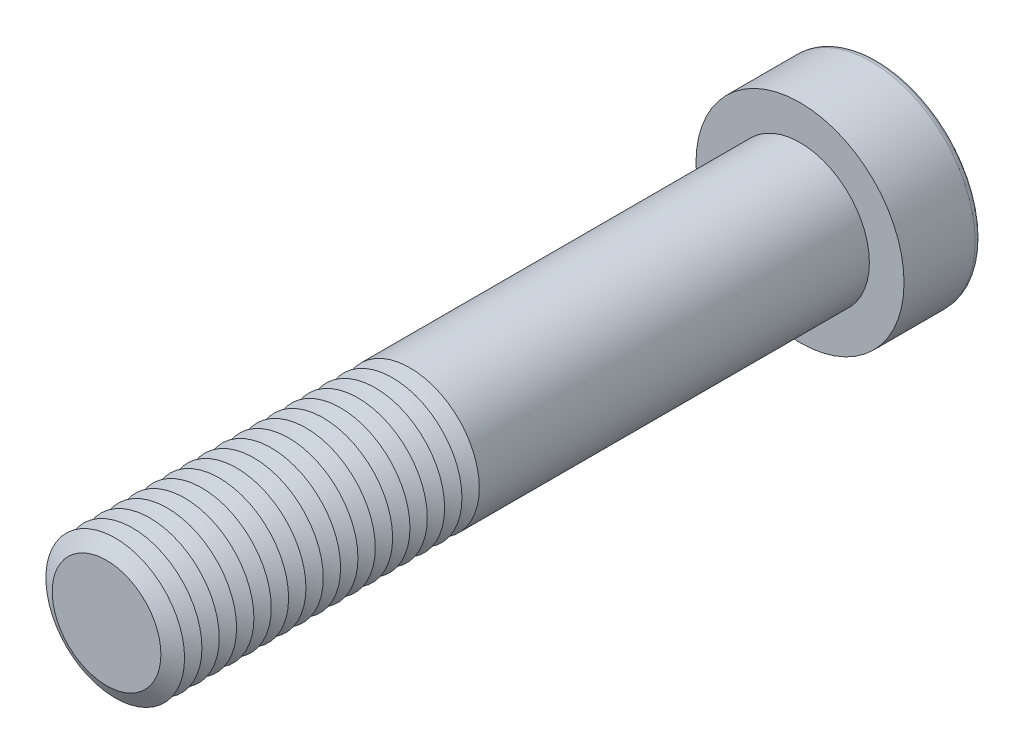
ISO-10303-21;
HEADER;
FILE_DESCRIPTION(('STEP AP214'),'2;1');
FILE_NAME('part.step','',(''),(''),'','','');
FILE_SCHEMA(('AUTOMOTIVE_DESIGN { 1 0 10303 214 1 1 1 1 }'));
ENDSEC;
DATA;
#1=APPLICATION_CONTEXT('core data for automotive mechanical design processes');
#2=APPLICATION_PROTOCOL_DEFINITION('international standard','automotive_design',2000,#1);
#3=PRODUCT_CONTEXT('',#1,'mechanical');
#4=PRODUCT('Part','Part','',(#3));
#5=PRODUCT_RELATED_PRODUCT_CATEGORY('part','',(#4));
#6=PRODUCT_DEFINITION_FORMATION('','',#4);
#7=PRODUCT_DEFINITION_CONTEXT('part definition',#1,'design');
#8=PRODUCT_DEFINITION('design','',#6,#7);
#9=PRODUCT_DEFINITION_SHAPE('','',#8);
#10=(LENGTH_UNIT() NAMED_UNIT(*) SI_UNIT(.MILLI.,.METRE.));
#11=(NAMED_UNIT(*) PLANE_ANGLE_UNIT() SI_UNIT($,.RADIAN.));
#12=(NAMED_UNIT(*) SI_UNIT($,.STERADIAN.) SOLID_ANGLE_UNIT());
#13=UNCERTAINTY_MEASURE_WITH_UNIT(LENGTH_MEASURE(1.E-05),#10,'distance_accuracy_value','');
#14=(GEOMETRIC_REPRESENTATION_CONTEXT(3) GLOBAL_UNCERTAINTY_ASSIGNED_CONTEXT((#13)) GLOBAL_UNIT_ASSIGNED_CONTEXT((#10,
#11,#12)) REPRESENTATION_CONTEXT('',''));
#15=CARTESIAN_POINT('',(0.,0.,0.));
#16=DIRECTION('',(0.,0.,1.));
#17=DIRECTION('',(1.,0.,0.));
#18=AXIS2_PLACEMENT_3D('',#15,#16,#17);
#19=CARTESIAN_POINT('',(0.,0.,73.));
#20=DIRECTION('',(0.,0.,1.));
#21=DIRECTION('',(1.,0.,0.));
#22=AXIS2_PLACEMENT_3D('',#19,#20,#21);
#23=CONICAL_SURFACE('',#22,8.,1.0471975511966);
#24=CARTESIAN_POINT('',(0.,0.,72.));
#25=DIRECTION('',(0.,0.,1.));
#26=DIRECTION('',(1.,0.,0.));
#27=AXIS2_PLACEMENT_3D('',#24,#25,#26);
#28=CIRCLE('',#27,6.26794919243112);
#29=CARTESIAN_POINT('',(6.26794919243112,0.,72.));
#30=VERTEX_POINT('',#29);
#31=EDGE_CURVE('E314',#30,#30,#28,.T.);
#32=ORIENTED_EDGE('',*,*,#31,.T.);
#33=EDGE_LOOP('',(#32));
#34=FACE_BOUND('',#33,.T.);
#35=CARTESIAN_POINT('',(0.,0.,73.));
#36=DIRECTION('',(0.,0.,1.));
#37=DIRECTION('',(1.,0.,0.));
#38=AXIS2_PLACEMENT_3D('',#35,#36,#37);
#39=CIRCLE('',#38,8.);
#40=CARTESIAN_POINT('',(8.,0.,73.));
#41=VERTEX_POINT('',#40);
#42=EDGE_CURVE('E317',#41,#41,#39,.T.);
#43=ORIENTED_EDGE('',*,*,#42,.F.);
#44=EDGE_LOOP('',(#43));
#45=FACE_BOUND('',#44,.T.);
#46=ADVANCED_FACE('F39',(#34,#45),#23,.T.);
#47=CARTESIAN_POINT('',(0.,0.,72.));
#48=DIRECTION('',(0.,0.,-1.));
#49=DIRECTION('',(-1.,0.,0.));
#50=AXIS2_PLACEMENT_3D('',#47,#48,#49);
#51=CONICAL_SURFACE('',#50,6.26794919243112,1.0471975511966);
#52=CARTESIAN_POINT('',(0.,0.,71.));
#53=DIRECTION('',(0.,0.,1.));
#54=DIRECTION('',(1.,0.,0.));
#55=AXIS2_PLACEMENT_3D('',#52,#53,#54);
#56=CIRCLE('',#55,8.);
#57=CARTESIAN_POINT('',(8.,0.,71.));
#58=VERTEX_POINT('',#57);
#59=EDGE_CURVE('E325',#58,#58,#56,.T.);
#60=ORIENTED_EDGE('',*,*,#59,.T.);
#61=EDGE_LOOP('',(#60));
#62=FACE_BOUND('',#61,.T.);
#63=ORIENTED_EDGE('',*,*,#31,.F.);
#64=EDGE_LOOP('',(#63));
#65=FACE_BOUND('',#64,.T.);
#66=ADVANCED_FACE('F245',(#62,#65),#51,.T.);
#67=CARTESIAN_POINT('',(0.,0.,80.));
#68=DIRECTION('',(0.,0.,1.));
#69=DIRECTION('',(1.,0.,0.));
#70=AXIS2_PLACEMENT_3D('',#67,#68,#69);
#71=PLANE('',#70);
#72=CARTESIAN_POINT('',(0.,0.,80.));
#73=DIRECTION('',(0.,0.,1.));
#74=DIRECTION('',(1.,0.,0.));
#75=AXIS2_PLACEMENT_3D('',#72,#73,#74);
#76=CIRCLE('',#75,6.26794919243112);
#77=CARTESIAN_POINT('',(6.26794919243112,0.,80.));
#78=VERTEX_POINT('',#77);
#79=EDGE_CURVE('E174',#78,#78,#76,.T.);
#80=ORIENTED_EDGE('',*,*,#79,.T.);
#81=EDGE_LOOP('',(#80));
#82=FACE_BOUND('',#81,.T.);
#83=ADVANCED_FACE('F251',(#82),#71,.T.);
#84=CARTESIAN_POINT('',(0.,0.,80.));
#85=DIRECTION('',(0.,0.,-1.));
#86=DIRECTION('',(-1.,0.,0.));
#87=AXIS2_PLACEMENT_3D('',#84,#85,#86);
#88=CONICAL_SURFACE('',#87,6.26794919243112,1.0471975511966);
#89=CARTESIAN_POINT('',(0.,0.,79.));
#90=DIRECTION('',(0.,0.,1.));
#91=DIRECTION('',(1.,0.,0.));
#92=AXIS2_PLACEMENT_3D('',#89,#90,#91);
#93=CIRCLE('',#92,8.);
#94=CARTESIAN_POINT('',(8.,0.,79.));
#95=VERTEX_POINT('',#94);
#96=EDGE_CURVE('E291',#95,#95,#93,.T.);
#97=ORIENTED_EDGE('',*,*,#96,.T.);
#98=EDGE_LOOP('',(#97));
#99=FACE_BOUND('',#98,.T.);
#100=ORIENTED_EDGE('',*,*,#79,.F.);
#101=EDGE_LOOP('',(#100));
#102=FACE_BOUND('',#101,.T.);
#103=ADVANCED_FACE('F199',(#99,#102),#88,.T.);
#104=CARTESIAN_POINT('',(0.,0.,79.));
#105=DIRECTION('',(0.,0.,1.));
#106=DIRECTION('',(1.,0.,0.));
#107=AXIS2_PLACEMENT_3D('',#104,#105,#106);
#108=CONICAL_SURFACE('',#107,8.,1.0471975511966);
#109=CARTESIAN_POINT('',(0.,0.,78.));
#110=DIRECTION('',(0.,0.,1.));
#111=DIRECTION('',(1.,0.,0.));
#112=AXIS2_PLACEMENT_3D('',#109,#110,#111);
#113=CIRCLE('',#112,6.26794919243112);
#114=CARTESIAN_POINT('',(6.26794919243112,0.,78.));
#115=VERTEX_POINT('',#114);
#116=EDGE_CURVE('E288',#115,#115,#113,.T.);
#117=ORIENTED_EDGE('',*,*,#116,.T.);
#118=EDGE_LOOP('',(#117));
#119=FACE_BOUND('',#118,.T.);
#120=ORIENTED_EDGE('',*,*,#96,.F.);
#121=EDGE_LOOP('',(#120));
#122=FACE_BOUND('',#121,.T.);
#123=ADVANCED_FACE('F277',(#119,#122),#108,.T.);
#124=CARTESIAN_POINT('',(0.,0.,78.));
#125=DIRECTION('',(0.,0.,-1.));
#126=DIRECTION('',(-1.,0.,0.));
#127=AXIS2_PLACEMENT_3D('',#124,#125,#126);
#128=CONICAL_SURFACE('',#127,6.26794919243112,1.0471975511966);
#129=CARTESIAN_POINT('',(0.,0.,77.));
#130=DIRECTION('',(0.,0.,1.));
#131=DIRECTION('',(1.,0.,0.));
#132=AXIS2_PLACEMENT_3D('',#129,#130,#131);
#133=CIRCLE('',#132,8.);
#134=CARTESIAN_POINT('',(8.,0.,77.));
#135=VERTEX_POINT('',#134);
#136=EDGE_CURVE('E300',#135,#135,#133,.T.);
#137=ORIENTED_EDGE('',*,*,#136,.T.);
#138=EDGE_LOOP('',(#137));
#139=FACE_BOUND('',#138,.T.);
#140=ORIENTED_EDGE('',*,*,#116,.F.);
#141=EDGE_LOOP('',(#140));
#142=FACE_BOUND('',#141,.T.);
#143=ADVANCED_FACE('F274',(#139,#142),#128,.T.);
#144=CARTESIAN_POINT('',(0.,0.,77.));
#145=DIRECTION('',(0.,0.,1.));
#146=DIRECTION('',(1.,0.,0.));
#147=AXIS2_PLACEMENT_3D('',#144,#145,#146);
#148=CONICAL_SURFACE('',#147,8.,1.0471975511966);
#149=CARTESIAN_POINT('',(0.,0.,76.));
#150=DIRECTION('',(0.,0.,1.));
#151=DIRECTION('',(1.,0.,0.));
#152=AXIS2_PLACEMENT_3D('',#149,#150,#151);
#153=CIRCLE('',#152,6.26794919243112);
#154=CARTESIAN_POINT('',(6.26794919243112,0.,76.));
#155=VERTEX_POINT('',#154);
#156=EDGE_CURVE('E293',#155,#155,#153,.T.);
#157=ORIENTED_EDGE('',*,*,#156,.T.);
#158=EDGE_LOOP('',(#157));
#159=FACE_BOUND('',#158,.T.);
#160=ORIENTED_EDGE('',*,*,#136,.F.);
#161=EDGE_LOOP('',(#160));
#162=FACE_BOUND('',#161,.T.);
#163=ADVANCED_FACE('F270',(#159,#162),#148,.T.);
#164=CARTESIAN_POINT('',(0.,0.,76.));
#165=DIRECTION('',(0.,0.,-1.));
#166=DIRECTION('',(-1.,0.,0.));
#167=AXIS2_PLACEMENT_3D('',#164,#165,#166);
#168=CONICAL_SURFACE('',#167,6.26794919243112,1.0471975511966);
#169=CARTESIAN_POINT('',(0.,0.,75.));
#170=DIRECTION('',(0.,0.,1.));
#171=DIRECTION('',(1.,0.,0.));
#172=AXIS2_PLACEMENT_3D('',#169,#170,#171);
#173=CIRCLE('',#172,8.);
#174=CARTESIAN_POINT('',(8.,0.,75.));
#175=VERTEX_POINT('',#174);
#176=EDGE_CURVE('E310',#175,#175,#173,.T.);
#177=ORIENTED_EDGE('',*,*,#176,.T.);
#178=EDGE_LOOP('',(#177));
#179=FACE_BOUND('',#178,.T.);
#180=ORIENTED_EDGE('',*,*,#156,.F.);
#181=EDGE_LOOP('',(#180));
#182=FACE_BOUND('',#181,.T.);
#183=ADVANCED_FACE('F266',(#179,#182),#168,.T.);
#184=CARTESIAN_POINT('',(0.,0.,75.));
#185=DIRECTION('',(0.,0.,1.));
#186=DIRECTION('',(1.,0.,0.));
#187=AXIS2_PLACEMENT_3D('',#184,#185,#186);
#188=CONICAL_SURFACE('',#187,8.,1.0471975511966);
#189=CARTESIAN_POINT('',(0.,0.,74.));
#190=DIRECTION('',(0.,0.,1.));
#191=DIRECTION('',(1.,0.,0.));
#192=AXIS2_PLACEMENT_3D('',#189,#190,#191);
#193=CIRCLE('',#192,6.26794919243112);
#194=CARTESIAN_POINT('',(6.26794919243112,0.,74.));
#195=VERTEX_POINT('',#194);
#196=EDGE_CURVE('E306',#195,#195,#193,.T.);
#197=ORIENTED_EDGE('',*,*,#196,.T.);
#198=EDGE_LOOP('',(#197));
#199=FACE_BOUND('',#198,.T.);
#200=ORIENTED_EDGE('',*,*,#176,.F.);
#201=EDGE_LOOP('',(#200));
#202=FACE_BOUND('',#201,.T.);
#203=ADVANCED_FACE('F262',(#199,#202),#188,.T.);
#204=CARTESIAN_POINT('',(0.,0.,74.));
#205=DIRECTION('',(0.,0.,-1.));
#206=DIRECTION('',(-1.,0.,0.));
#207=AXIS2_PLACEMENT_3D('',#204,#205,#206);
#208=CONICAL_SURFACE('',#207,6.26794919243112,1.0471975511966);
#209=ORIENTED_EDGE('',*,*,#42,.T.);
#210=EDGE_LOOP('',(#209));
#211=FACE_BOUND('',#210,.T.);
#212=ORIENTED_EDGE('',*,*,#196,.F.);
#213=EDGE_LOOP('',(#212));
#214=FACE_BOUND('',#213,.T.);
#215=ADVANCED_FACE('F258',(#211,#214),#208,.T.);
#216=CARTESIAN_POINT('',(0.,0.,71.));
#217=DIRECTION('',(0.,0.,1.));
#218=DIRECTION('',(1.,0.,0.));
#219=AXIS2_PLACEMENT_3D('',#216,#217,#218);
#220=CONICAL_SURFACE('',#219,8.,1.0471975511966);
#221=CARTESIAN_POINT('',(0.,0.,70.));
#222=DIRECTION('',(0.,0.,1.));
#223=DIRECTION('',(1.,0.,0.));
#224=AXIS2_PLACEMENT_3D('',#221,#222,#223);
#225=CIRCLE('',#224,6.26794919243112);
#226=CARTESIAN_POINT('',(6.26794919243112,0.,70.));
#227=VERTEX_POINT('',#226);
#228=EDGE_CURVE('E321',#227,#227,#225,.T.);
#229=ORIENTED_EDGE('',*,*,#228,.T.);
#230=EDGE_LOOP('',(#229));
#231=FACE_BOUND('',#230,.T.);
#232=ORIENTED_EDGE('',*,*,#59,.F.);
#233=EDGE_LOOP('',(#232));
#234=FACE_BOUND('',#233,.T.);
#235=ADVANCED_FACE('F261',(#231,#234),#220,.T.);
#236=CARTESIAN_POINT('',(0.,0.,70.));
#237=DIRECTION('',(0.,0.,-1.));
#238=DIRECTION('',(-1.,0.,0.));
#239=AXIS2_PLACEMENT_3D('',#236,#237,#238);
#240=CONICAL_SURFACE('',#239,6.26794919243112,1.0471975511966);
#241=CARTESIAN_POINT('',(0.,0.,69.));
#242=DIRECTION('',(0.,0.,1.));
#243=DIRECTION('',(1.,0.,0.));
#244=AXIS2_PLACEMENT_3D('',#241,#242,#243);
#245=CIRCLE('',#244,8.);
#246=CARTESIAN_POINT('',(8.,0.,69.));
#247=VERTEX_POINT('',#246);
#248=EDGE_CURVE('E333',#247,#247,#245,.T.);
#249=ORIENTED_EDGE('',*,*,#248,.T.);
#250=EDGE_LOOP('',(#249));
#251=FACE_BOUND('',#250,.T.);
#252=ORIENTED_EDGE('',*,*,#228,.F.);
#253=EDGE_LOOP('',(#252));
#254=FACE_BOUND('',#253,.T.);
#255=ADVANCED_FACE('F528',(#251,#254),#240,.T.);
#256=CARTESIAN_POINT('',(0.,0.,69.));
#257=DIRECTION('',(0.,0.,1.));
#258=DIRECTION('',(1.,0.,0.));
#259=AXIS2_PLACEMENT_3D('',#256,#257,#258);
#260=CONICAL_SURFACE('',#259,8.,1.0471975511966);
#261=CARTESIAN_POINT('',(0.,0.,68.));
#262=DIRECTION('',(0.,0.,1.));
#263=DIRECTION('',(1.,0.,0.));
#264=AXIS2_PLACEMENT_3D('',#261,#262,#263);
#265=CIRCLE('',#264,6.26794919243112);
#266=CARTESIAN_POINT('',(6.26794919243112,0.,68.));
#267=VERTEX_POINT('',#266);
#268=EDGE_CURVE('E329',#267,#267,#265,.T.);
#269=ORIENTED_EDGE('',*,*,#268,.T.);
#270=EDGE_LOOP('',(#269));
#271=FACE_BOUND('',#270,.T.);
#272=ORIENTED_EDGE('',*,*,#248,.F.);
#273=EDGE_LOOP('',(#272));
#274=FACE_BOUND('',#273,.T.);
#275=ADVANCED_FACE('F524',(#271,#274),#260,.T.);
#276=CARTESIAN_POINT('',(0.,0.,68.));
#277=DIRECTION('',(0.,0.,-1.));
#278=DIRECTION('',(-1.,0.,0.));
#279=AXIS2_PLACEMENT_3D('',#276,#277,#278);
#280=CONICAL_SURFACE('',#279,6.26794919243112,1.0471975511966);
#281=CARTESIAN_POINT('',(0.,0.,67.));
#282=DIRECTION('',(0.,0.,1.));
#283=DIRECTION('',(1.,0.,0.));
#284=AXIS2_PLACEMENT_3D('',#281,#282,#283);
#285=CIRCLE('',#284,8.);
#286=CARTESIAN_POINT('',(8.,0.,67.));
#287=VERTEX_POINT('',#286);
#288=EDGE_CURVE('E341',#287,#287,#285,.T.);
#289=ORIENTED_EDGE('',*,*,#288,.T.);
#290=EDGE_LOOP('',(#289));
#291=FACE_BOUND('',#290,.T.);
#292=ORIENTED_EDGE('',*,*,#268,.F.);
#293=EDGE_LOOP('',(#292));
#294=FACE_BOUND('',#293,.T.);
#295=ADVANCED_FACE('F520',(#291,#294),#280,.T.);
#296=CARTESIAN_POINT('',(0.,0.,67.));
#297=DIRECTION('',(0.,0.,1.));
#298=DIRECTION('',(1.,0.,0.));
#299=AXIS2_PLACEMENT_3D('',#296,#297,#298);
#300=CONICAL_SURFACE('',#299,8.,1.0471975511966);
#301=CARTESIAN_POINT('',(0.,0.,66.));
#302=DIRECTION('',(0.,0.,1.));
#303=DIRECTION('',(1.,0.,0.));
#304=AXIS2_PLACEMENT_3D('',#301,#302,#303);
#305=CIRCLE('',#304,6.26794919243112);
#306=CARTESIAN_POINT('',(6.26794919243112,0.,66.));
#307=VERTEX_POINT('',#306);
#308=EDGE_CURVE('E337',#307,#307,#305,.T.);
#309=ORIENTED_EDGE('',*,*,#308,.T.);
#310=EDGE_LOOP('',(#309));
#311=FACE_BOUND('',#310,.T.);
#312=ORIENTED_EDGE('',*,*,#288,.F.);
#313=EDGE_LOOP('',(#312));
#314=FACE_BOUND('',#313,.T.);
#315=ADVANCED_FACE('F516',(#311,#314),#300,.T.);
#316=CARTESIAN_POINT('',(0.,0.,66.));
#317=DIRECTION('',(0.,0.,-1.));
#318=DIRECTION('',(-1.,0.,0.));
#319=AXIS2_PLACEMENT_3D('',#316,#317,#318);
#320=CONICAL_SURFACE('',#319,6.26794919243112,1.0471975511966);
#321=CARTESIAN_POINT('',(0.,0.,65.));
#322=DIRECTION('',(0.,0.,1.));
#323=DIRECTION('',(1.,0.,0.));
#324=AXIS2_PLACEMENT_3D('',#321,#322,#323);
#325=CIRCLE('',#324,8.);
#326=CARTESIAN_POINT('',(8.,0.,65.));
#327=VERTEX_POINT('',#326);
#328=EDGE_CURVE('E349',#327,#327,#325,.T.);
#329=ORIENTED_EDGE('',*,*,#328,.T.);
#330=EDGE_LOOP('',(#329));
#331=FACE_BOUND('',#330,.T.);
#332=ORIENTED_EDGE('',*,*,#308,.F.);
#333=EDGE_LOOP('',(#332));
#334=FACE_BOUND('',#333,.T.);
#335=ADVANCED_FACE('F512',(#331,#334),#320,.T.);
#336=CARTESIAN_POINT('',(0.,0.,65.));
#337=DIRECTION('',(0.,0.,1.));
#338=DIRECTION('',(1.,0.,0.));
#339=AXIS2_PLACEMENT_3D('',#336,#337,#338);
#340=CONICAL_SURFACE('',#339,8.,1.0471975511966);
#341=CARTESIAN_POINT('',(0.,0.,64.));
#342=DIRECTION('',(0.,0.,1.));
#343=DIRECTION('',(1.,0.,0.));
#344=AXIS2_PLACEMENT_3D('',#341,#342,#343);
#345=CIRCLE('',#344,6.26794919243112);
#346=CARTESIAN_POINT('',(6.26794919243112,0.,64.));
#347=VERTEX_POINT('',#346);
#348=EDGE_CURVE('E345',#347,#347,#345,.T.);
#349=ORIENTED_EDGE('',*,*,#348,.T.);
#350=EDGE_LOOP('',(#349));
#351=FACE_BOUND('',#350,.T.);
#352=ORIENTED_EDGE('',*,*,#328,.F.);
#353=EDGE_LOOP('',(#352));
#354=FACE_BOUND('',#353,.T.);
#355=ADVANCED_FACE('F508',(#351,#354),#340,.T.);
#356=CARTESIAN_POINT('',(0.,0.,64.));
#357=DIRECTION('',(0.,0.,-1.));
#358=DIRECTION('',(-1.,0.,0.));
#359=AXIS2_PLACEMENT_3D('',#356,#357,#358);
#360=CONICAL_SURFACE('',#359,6.26794919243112,1.0471975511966);
#361=CARTESIAN_POINT('',(0.,0.,63.));
#362=DIRECTION('',(0.,0.,1.));
#363=DIRECTION('',(1.,0.,0.));
#364=AXIS2_PLACEMENT_3D('',#361,#362,#363);
#365=CIRCLE('',#364,8.);
#366=CARTESIAN_POINT('',(8.,0.,63.));
#367=VERTEX_POINT('',#366);
#368=EDGE_CURVE('E357',#367,#367,#365,.T.);
#369=ORIENTED_EDGE('',*,*,#368,.T.);
#370=EDGE_LOOP('',(#369));
#371=FACE_BOUND('',#370,.T.);
#372=ORIENTED_EDGE('',*,*,#348,.F.);
#373=EDGE_LOOP('',(#372));
#374=FACE_BOUND('',#373,.T.);
#375=ADVANCED_FACE('F504',(#371,#374),#360,.T.);
#376=CARTESIAN_POINT('',(0.,0.,63.));
#377=DIRECTION('',(0.,0.,1.));
#378=DIRECTION('',(1.,0.,0.));
#379=AXIS2_PLACEMENT_3D('',#376,#377,#378);
#380=CONICAL_SURFACE('',#379,8.,1.0471975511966);
#381=CARTESIAN_POINT('',(0.,0.,62.));
#382=DIRECTION('',(0.,0.,1.));
#383=DIRECTION('',(1.,0.,0.));
#384=AXIS2_PLACEMENT_3D('',#381,#382,#383);
#385=CIRCLE('',#384,6.26794919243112);
#386=CARTESIAN_POINT('',(6.26794919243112,0.,62.));
#387=VERTEX_POINT('',#386);
#388=EDGE_CURVE('E353',#387,#387,#385,.T.);
#389=ORIENTED_EDGE('',*,*,#388,.T.);
#390=EDGE_LOOP('',(#389));
#391=FACE_BOUND('',#390,.T.);
#392=ORIENTED_EDGE('',*,*,#368,.F.);
#393=EDGE_LOOP('',(#392));
#394=FACE_BOUND('',#393,.T.);
#395=ADVANCED_FACE('F500',(#391,#394),#380,.T.);
#396=CARTESIAN_POINT('',(0.,0.,62.));
#397=DIRECTION('',(0.,0.,-1.));
#398=DIRECTION('',(-1.,0.,0.));
#399=AXIS2_PLACEMENT_3D('',#396,#397,#398);
#400=CONICAL_SURFACE('',#399,6.26794919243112,1.0471975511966);
#401=CARTESIAN_POINT('',(0.,0.,61.));
#402=DIRECTION('',(0.,0.,1.));
#403=DIRECTION('',(1.,0.,0.));
#404=AXIS2_PLACEMENT_3D('',#401,#402,#403);
#405=CIRCLE('',#404,8.);
#406=CARTESIAN_POINT('',(8.,0.,61.));
#407=VERTEX_POINT('',#406);
#408=EDGE_CURVE('E365',#407,#407,#405,.T.);
#409=ORIENTED_EDGE('',*,*,#408,.T.);
#410=EDGE_LOOP('',(#409));
#411=FACE_BOUND('',#410,.T.);
#412=ORIENTED_EDGE('',*,*,#388,.F.);
#413=EDGE_LOOP('',(#412));
#414=FACE_BOUND('',#413,.T.);
#415=ADVANCED_FACE('F496',(#411,#414),#400,.T.);
#416=CARTESIAN_POINT('',(0.,0.,61.));
#417=DIRECTION('',(0.,0.,1.));
#418=DIRECTION('',(1.,0.,0.));
#419=AXIS2_PLACEMENT_3D('',#416,#417,#418);
#420=CONICAL_SURFACE('',#419,8.,1.0471975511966);
#421=CARTESIAN_POINT('',(0.,0.,60.));
#422=DIRECTION('',(0.,0.,1.));
#423=DIRECTION('',(1.,0.,0.));
#424=AXIS2_PLACEMENT_3D('',#421,#422,#423);
#425=CIRCLE('',#424,6.26794919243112);
#426=CARTESIAN_POINT('',(6.26794919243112,0.,60.));
#427=VERTEX_POINT('',#426);
#428=EDGE_CURVE('E361',#427,#427,#425,.T.);
#429=ORIENTED_EDGE('',*,*,#428,.T.);
#430=EDGE_LOOP('',(#429));
#431=FACE_BOUND('',#430,.T.);
#432=ORIENTED_EDGE('',*,*,#408,.F.);
#433=EDGE_LOOP('',(#432));
#434=FACE_BOUND('',#433,.T.);
#435=ADVANCED_FACE('F492',(#431,#434),#420,.T.);
#436=CARTESIAN_POINT('',(0.,0.,60.));
#437=DIRECTION('',(0.,0.,-1.));
#438=DIRECTION('',(-1.,0.,0.));
#439=AXIS2_PLACEMENT_3D('',#436,#437,#438);
#440=CONICAL_SURFACE('',#439,6.26794919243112,1.0471975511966);
#441=CARTESIAN_POINT('',(0.,0.,59.));
#442=DIRECTION('',(0.,0.,1.));
#443=DIRECTION('',(1.,0.,0.));
#444=AXIS2_PLACEMENT_3D('',#441,#442,#443);
#445=CIRCLE('',#444,8.);
#446=CARTESIAN_POINT('',(8.,0.,59.));
#447=VERTEX_POINT('',#446);
#448=EDGE_CURVE('E372',#447,#447,#445,.T.);
#449=ORIENTED_EDGE('',*,*,#448,.T.);
#450=EDGE_LOOP('',(#449));
#451=FACE_BOUND('',#450,.T.);
#452=ORIENTED_EDGE('',*,*,#428,.F.);
#453=EDGE_LOOP('',(#452));
#454=FACE_BOUND('',#453,.T.);
#455=ADVANCED_FACE('F488',(#451,#454),#440,.T.);
#456=CARTESIAN_POINT('',(0.,0.,59.));
#457=DIRECTION('',(0.,0.,1.));
#458=DIRECTION('',(1.,0.,0.));
#459=AXIS2_PLACEMENT_3D('',#456,#457,#458);
#460=CONICAL_SURFACE('',#459,8.,1.0471975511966);
#461=CARTESIAN_POINT('',(0.,0.,58.));
#462=DIRECTION('',(0.,0.,1.));
#463=DIRECTION('',(1.,0.,0.));
#464=AXIS2_PLACEMENT_3D('',#461,#462,#463);
#465=CIRCLE('',#464,6.26794919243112);
#466=CARTESIAN_POINT('',(6.26794919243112,0.,58.));
#467=VERTEX_POINT('',#466);
#468=EDGE_CURVE('E369',#467,#467,#465,.T.);
#469=ORIENTED_EDGE('',*,*,#468,.T.);
#470=EDGE_LOOP('',(#469));
#471=FACE_BOUND('',#470,.T.);
#472=ORIENTED_EDGE('',*,*,#448,.F.);
#473=EDGE_LOOP('',(#472));
#474=FACE_BOUND('',#473,.T.);
#475=ADVANCED_FACE('F484',(#471,#474),#460,.T.);
#476=CARTESIAN_POINT('',(0.,0.,58.));
#477=DIRECTION('',(0.,0.,-1.));
#478=DIRECTION('',(-1.,0.,0.));
#479=AXIS2_PLACEMENT_3D('',#476,#477,#478);
#480=CONICAL_SURFACE('',#479,6.26794919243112,1.0471975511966);
#481=CARTESIAN_POINT('',(0.,0.,57.));
#482=DIRECTION('',(0.,0.,1.));
#483=DIRECTION('',(1.,0.,0.));
#484=AXIS2_PLACEMENT_3D('',#481,#482,#483);
#485=CIRCLE('',#484,8.);
#486=CARTESIAN_POINT('',(8.,0.,57.));
#487=VERTEX_POINT('',#486);
#488=EDGE_CURVE('E380',#487,#487,#485,.T.);
#489=ORIENTED_EDGE('',*,*,#488,.T.);
#490=EDGE_LOOP('',(#489));
#491=FACE_BOUND('',#490,.T.);
#492=ORIENTED_EDGE('',*,*,#468,.F.);
#493=EDGE_LOOP('',(#492));
#494=FACE_BOUND('',#493,.T.);
#495=ADVANCED_FACE('F480',(#491,#494),#480,.T.);
#496=CARTESIAN_POINT('',(0.,0.,57.));
#497=DIRECTION('',(0.,0.,1.));
#498=DIRECTION('',(1.,0.,0.));
#499=AXIS2_PLACEMENT_3D('',#496,#497,#498);
#500=CONICAL_SURFACE('',#499,8.,1.0471975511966);
#501=CARTESIAN_POINT('',(0.,0.,56.));
#502=DIRECTION('',(0.,0.,1.));
#503=DIRECTION('',(1.,0.,0.));
#504=AXIS2_PLACEMENT_3D('',#501,#502,#503);
#505=CIRCLE('',#504,6.26794919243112);
#506=CARTESIAN_POINT('',(6.26794919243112,0.,56.));
#507=VERTEX_POINT('',#506);
#508=EDGE_CURVE('E376',#507,#507,#505,.T.);
#509=ORIENTED_EDGE('',*,*,#508,.T.);
#510=EDGE_LOOP('',(#509));
#511=FACE_BOUND('',#510,.T.);
#512=ORIENTED_EDGE('',*,*,#488,.F.);
#513=EDGE_LOOP('',(#512));
#514=FACE_BOUND('',#513,.T.);
#515=ADVANCED_FACE('F476',(#511,#514),#500,.T.);
#516=CARTESIAN_POINT('',(0.,0.,56.));
#517=DIRECTION('',(0.,0.,-1.));
#518=DIRECTION('',(-1.,0.,0.));
#519=AXIS2_PLACEMENT_3D('',#516,#517,#518);
#520=CONICAL_SURFACE('',#519,6.26794919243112,1.0471975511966);
#521=CARTESIAN_POINT('',(0.,0.,55.));
#522=DIRECTION('',(0.,0.,1.));
#523=DIRECTION('',(1.,0.,0.));
#524=AXIS2_PLACEMENT_3D('',#521,#522,#523);
#525=CIRCLE('',#524,8.);
#526=CARTESIAN_POINT('',(8.,0.,55.));
#527=VERTEX_POINT('',#526);
#528=EDGE_CURVE('E388',#527,#527,#525,.T.);
#529=ORIENTED_EDGE('',*,*,#528,.T.);
#530=EDGE_LOOP('',(#529));
#531=FACE_BOUND('',#530,.T.);
#532=ORIENTED_EDGE('',*,*,#508,.F.);
#533=EDGE_LOOP('',(#532));
#534=FACE_BOUND('',#533,.T.);
#535=ADVANCED_FACE('F472',(#531,#534),#520,.T.);
#536=CARTESIAN_POINT('',(0.,0.,55.));
#537=DIRECTION('',(0.,0.,1.));
#538=DIRECTION('',(1.,0.,0.));
#539=AXIS2_PLACEMENT_3D('',#536,#537,#538);
#540=CONICAL_SURFACE('',#539,8.,1.0471975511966);
#541=CARTESIAN_POINT('',(0.,0.,54.));
#542=DIRECTION('',(0.,0.,1.));
#543=DIRECTION('',(1.,0.,0.));
#544=AXIS2_PLACEMENT_3D('',#541,#542,#543);
#545=CIRCLE('',#544,6.26794919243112);
#546=CARTESIAN_POINT('',(6.26794919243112,0.,54.));
#547=VERTEX_POINT('',#546);
#548=EDGE_CURVE('E384',#547,#547,#545,.T.);
#549=ORIENTED_EDGE('',*,*,#548,.T.);
#550=EDGE_LOOP('',(#549));
#551=FACE_BOUND('',#550,.T.);
#552=ORIENTED_EDGE('',*,*,#528,.F.);
#553=EDGE_LOOP('',(#552));
#554=FACE_BOUND('',#553,.T.);
#555=ADVANCED_FACE('F468',(#551,#554),#540,.T.);
#556=CARTESIAN_POINT('',(0.,0.,54.));
#557=DIRECTION('',(0.,0.,-1.));
#558=DIRECTION('',(-1.,0.,0.));
#559=AXIS2_PLACEMENT_3D('',#556,#557,#558);
#560=CONICAL_SURFACE('',#559,6.26794919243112,1.0471975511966);
#561=CARTESIAN_POINT('',(0.,0.,53.));
#562=DIRECTION('',(0.,0.,1.));
#563=DIRECTION('',(1.,0.,0.));
#564=AXIS2_PLACEMENT_3D('',#561,#562,#563);
#565=CIRCLE('',#564,8.);
#566=CARTESIAN_POINT('',(8.,0.,53.));
#567=VERTEX_POINT('',#566);
#568=EDGE_CURVE('E396',#567,#567,#565,.T.);
#569=ORIENTED_EDGE('',*,*,#568,.T.);
#570=EDGE_LOOP('',(#569));
#571=FACE_BOUND('',#570,.T.);
#572=ORIENTED_EDGE('',*,*,#548,.F.);
#573=EDGE_LOOP('',(#572));
#574=FACE_BOUND('',#573,.T.);
#575=ADVANCED_FACE('F464',(#571,#574),#560,.T.);
#576=CARTESIAN_POINT('',(0.,0.,53.));
#577=DIRECTION('',(0.,0.,1.));
#578=DIRECTION('',(1.,0.,0.));
#579=AXIS2_PLACEMENT_3D('',#576,#577,#578);
#580=CONICAL_SURFACE('',#579,8.,1.0471975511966);
#581=CARTESIAN_POINT('',(0.,0.,52.));
#582=DIRECTION('',(0.,0.,1.));
#583=DIRECTION('',(1.,0.,0.));
#584=AXIS2_PLACEMENT_3D('',#581,#582,#583);
#585=CIRCLE('',#584,6.26794919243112);
#586=CARTESIAN_POINT('',(6.26794919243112,0.,52.));
#587=VERTEX_POINT('',#586);
#588=EDGE_CURVE('E392',#587,#587,#585,.T.);
#589=ORIENTED_EDGE('',*,*,#588,.T.);
#590=EDGE_LOOP('',(#589));
#591=FACE_BOUND('',#590,.T.);
#592=ORIENTED_EDGE('',*,*,#568,.F.);
#593=EDGE_LOOP('',(#592));
#594=FACE_BOUND('',#593,.T.);
#595=ADVANCED_FACE('F460',(#591,#594),#580,.T.);
#596=CARTESIAN_POINT('',(0.,0.,52.));
#597=DIRECTION('',(0.,0.,-1.));
#598=DIRECTION('',(-1.,0.,0.));
#599=AXIS2_PLACEMENT_3D('',#596,#597,#598);
#600=CONICAL_SURFACE('',#599,6.26794919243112,1.0471975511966);
#601=CARTESIAN_POINT('',(0.,0.,51.));
#602=DIRECTION('',(0.,0.,1.));
#603=DIRECTION('',(1.,0.,0.));
#604=AXIS2_PLACEMENT_3D('',#601,#602,#603);
#605=CIRCLE('',#604,8.);
#606=CARTESIAN_POINT('',(8.,0.,51.));
#607=VERTEX_POINT('',#606);
#608=EDGE_CURVE('E404',#607,#607,#605,.T.);
#609=ORIENTED_EDGE('',*,*,#608,.T.);
#610=EDGE_LOOP('',(#609));
#611=FACE_BOUND('',#610,.T.);
#612=ORIENTED_EDGE('',*,*,#588,.F.);
#613=EDGE_LOOP('',(#612));
#614=FACE_BOUND('',#613,.T.);
#615=ADVANCED_FACE('F456',(#611,#614),#600,.T.);
#616=CARTESIAN_POINT('',(0.,0.,51.));
#617=DIRECTION('',(0.,0.,1.));
#618=DIRECTION('',(1.,0.,0.));
#619=AXIS2_PLACEMENT_3D('',#616,#617,#618);
#620=CONICAL_SURFACE('',#619,8.,1.0471975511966);
#621=CARTESIAN_POINT('',(0.,0.,50.));
#622=DIRECTION('',(0.,0.,1.));
#623=DIRECTION('',(1.,0.,0.));
#624=AXIS2_PLACEMENT_3D('',#621,#622,#623);
#625=CIRCLE('',#624,6.26794919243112);
#626=CARTESIAN_POINT('',(6.26794919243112,0.,50.));
#627=VERTEX_POINT('',#626);
#628=EDGE_CURVE('E400',#627,#627,#625,.T.);
#629=ORIENTED_EDGE('',*,*,#628,.T.);
#630=EDGE_LOOP('',(#629));
#631=FACE_BOUND('',#630,.T.);
#632=ORIENTED_EDGE('',*,*,#608,.F.);
#633=EDGE_LOOP('',(#632));
#634=FACE_BOUND('',#633,.T.);
#635=ADVANCED_FACE('F452',(#631,#634),#620,.T.);
#636=CARTESIAN_POINT('',(0.,0.,50.));
#637=DIRECTION('',(0.,0.,-1.));
#638=DIRECTION('',(-1.,0.,0.));
#639=AXIS2_PLACEMENT_3D('',#636,#637,#638);
#640=CONICAL_SURFACE('',#639,6.26794919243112,1.0471975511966);
#641=CARTESIAN_POINT('',(0.,0.,49.));
#642=DIRECTION('',(0.,0.,1.));
#643=DIRECTION('',(1.,0.,0.));
#644=AXIS2_PLACEMENT_3D('',#641,#642,#643);
#645=CIRCLE('',#644,8.);
#646=CARTESIAN_POINT('',(8.,0.,49.));
#647=VERTEX_POINT('',#646);
#648=EDGE_CURVE('E411',#647,#647,#645,.T.);
#649=ORIENTED_EDGE('',*,*,#648,.T.);
#650=EDGE_LOOP('',(#649));
#651=FACE_BOUND('',#650,.T.);
#652=ORIENTED_EDGE('',*,*,#628,.F.);
#653=EDGE_LOOP('',(#652));
#654=FACE_BOUND('',#653,.T.);
#655=ADVANCED_FACE('F448',(#651,#654),#640,.T.);
#656=CARTESIAN_POINT('',(0.,0.,49.));
#657=DIRECTION('',(0.,0.,1.));
#658=DIRECTION('',(1.,0.,0.));
#659=AXIS2_PLACEMENT_3D('',#656,#657,#658);
#660=CONICAL_SURFACE('',#659,8.,1.0471975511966);
#661=CARTESIAN_POINT('',(0.,0.,48.));
#662=DIRECTION('',(0.,0.,1.));
#663=DIRECTION('',(1.,0.,0.));
#664=AXIS2_PLACEMENT_3D('',#661,#662,#663);
#665=CIRCLE('',#664,6.26794919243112);
#666=CARTESIAN_POINT('',(6.26794919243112,0.,48.));
#667=VERTEX_POINT('',#666);
#668=EDGE_CURVE('E408',#667,#667,#665,.T.);
#669=ORIENTED_EDGE('',*,*,#668,.T.);
#670=EDGE_LOOP('',(#669));
#671=FACE_BOUND('',#670,.T.);
#672=ORIENTED_EDGE('',*,*,#648,.F.);
#673=EDGE_LOOP('',(#672));
#674=FACE_BOUND('',#673,.T.);
#675=ADVANCED_FACE('F443',(#671,#674),#660,.T.);
#676=CARTESIAN_POINT('',(0.,0.,48.));
#677=DIRECTION('',(0.,0.,-1.));
#678=DIRECTION('',(-1.,0.,0.));
#679=AXIS2_PLACEMENT_3D('',#676,#677,#678);
#680=CONICAL_SURFACE('',#679,6.26794919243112,1.0471975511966);
#681=CARTESIAN_POINT('',(0.,0.,47.));
#682=DIRECTION('',(0.,0.,1.));
#683=DIRECTION('',(1.,0.,0.));
#684=AXIS2_PLACEMENT_3D('',#681,#682,#683);
#685=CIRCLE('',#684,8.);
#686=CARTESIAN_POINT('',(8.,0.,47.));
#687=VERTEX_POINT('',#686);
#688=EDGE_CURVE('E423',#687,#687,#685,.T.);
#689=ORIENTED_EDGE('',*,*,#688,.T.);
#690=EDGE_LOOP('',(#689));
#691=FACE_BOUND('',#690,.T.);
#692=ORIENTED_EDGE('',*,*,#668,.F.);
#693=EDGE_LOOP('',(#692));
#694=FACE_BOUND('',#693,.T.);
#695=ADVANCED_FACE('F429',(#691,#694),#680,.T.);
#696=CARTESIAN_POINT('',(0.,0.,47.));
#697=DIRECTION('',(0.,0.,1.));
#698=DIRECTION('',(1.,0.,0.));
#699=AXIS2_PLACEMENT_3D('',#696,#697,#698);
#700=CONICAL_SURFACE('',#699,8.,1.0471975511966);
#701=CARTESIAN_POINT('',(0.,0.,46.));
#702=DIRECTION('',(0.,0.,1.));
#703=DIRECTION('',(1.,0.,0.));
#704=AXIS2_PLACEMENT_3D('',#701,#702,#703);
#705=CIRCLE('',#704,6.26794919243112);
#706=CARTESIAN_POINT('',(6.26794919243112,0.,46.));
#707=VERTEX_POINT('',#706);
#708=EDGE_CURVE('E415',#707,#707,#705,.T.);
#709=ORIENTED_EDGE('',*,*,#708,.T.);
#710=EDGE_LOOP('',(#709));
#711=FACE_BOUND('',#710,.T.);
#712=ORIENTED_EDGE('',*,*,#688,.F.);
#713=EDGE_LOOP('',(#712));
#714=FACE_BOUND('',#713,.T.);
#715=ADVANCED_FACE('F432',(#711,#714),#700,.T.);
#716=CARTESIAN_POINT('',(0.,0.,46.));
#717=DIRECTION('',(0.,0.,-1.));
#718=DIRECTION('',(-1.,0.,0.));
#719=AXIS2_PLACEMENT_3D('',#716,#717,#718);
#720=CONICAL_SURFACE('',#719,6.26794919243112,1.0471975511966);
#721=CARTESIAN_POINT('',(0.,0.,45.));
#722=DIRECTION('',(0.,0.,1.));
#723=DIRECTION('',(1.,0.,0.));
#724=AXIS2_PLACEMENT_3D('',#721,#722,#723);
#725=CIRCLE('',#724,8.);
#726=CARTESIAN_POINT('',(8.,0.,45.));
#727=VERTEX_POINT('',#726);
#728=EDGE_CURVE('E419',#727,#727,#725,.T.);
#729=ORIENTED_EDGE('',*,*,#728,.T.);
#730=EDGE_LOOP('',(#729));
#731=FACE_BOUND('',#730,.T.);
#732=ORIENTED_EDGE('',*,*,#708,.F.);
#733=EDGE_LOOP('',(#732));
#734=FACE_BOUND('',#733,.T.);
#735=ADVANCED_FACE('F434',(#731,#734),#720,.T.);
#736=CARTESIAN_POINT('',(0.,0.,0.));
#737=DIRECTION('',(0.,0.,-1.));
#738=DIRECTION('',(-1.,0.,0.));
#739=AXIS2_PLACEMENT_3D('',#736,#737,#738);
#740=CONICAL_SURFACE('',#739,6.,1.0471975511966);
#741=CARTESIAN_POINT('',(0.,0.,3.46410161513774));
#742=VERTEX_POINT('',#741);
#743=VERTEX_LOOP('',#742);
#744=FACE_BOUND('',#743,.T.);
#745=CARTESIAN_POINT('',(0.,0.,0.));
#746=DIRECTION('',(0.,0.,-1.));
#747=DIRECTION('',(-1.,0.,0.));
#748=AXIS2_PLACEMENT_3D('',#745,#746,#747);
#749=CIRCLE('',#748,6.);
#750=CARTESIAN_POINT('',(-5.19615242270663,3.,0.));
#751=VERTEX_POINT('',#750);
#752=CARTESIAN_POINT('',(0.,6.,0.));
#753=VERTEX_POINT('',#752);
#754=EDGE_CURVE('E149',#751,#753,#749,.T.);
#755=ORIENTED_EDGE('',*,*,#754,.T.);
#756=CARTESIAN_POINT('',(0.,0.,0.));
#757=DIRECTION('',(0.,0.,-1.));
#758=DIRECTION('',(-1.,0.,0.));
#759=AXIS2_PLACEMENT_3D('',#756,#757,#758);
#760=CIRCLE('',#759,6.);
#761=CARTESIAN_POINT('',(5.19615242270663,3.,0.));
#762=VERTEX_POINT('',#761);
#763=EDGE_CURVE('E54',#753,#762,#760,.T.);
#764=ORIENTED_EDGE('',*,*,#763,.T.);
#765=CARTESIAN_POINT('',(5.19615242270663,-3.,0.));
#766=VERTEX_POINT('',#765);
#767=EDGE_CURVE('E1056',#762,#766,#760,.T.);
#768=ORIENTED_EDGE('',*,*,#767,.T.);
#769=CARTESIAN_POINT('',(0.,-6.,0.));
#770=VERTEX_POINT('',#769);
#771=EDGE_CURVE('E1054',#766,#770,#760,.T.);
#772=ORIENTED_EDGE('',*,*,#771,.T.);
#773=CARTESIAN_POINT('',(-5.19615242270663,-3.,0.));
#774=VERTEX_POINT('',#773);
#775=EDGE_CURVE('E1049',#770,#774,#760,.T.);
#776=ORIENTED_EDGE('',*,*,#775,.T.);
#777=EDGE_CURVE('E1047',#774,#751,#760,.T.);
#778=ORIENTED_EDGE('',*,*,#777,.T.);
#779=EDGE_LOOP('',(#755,#764,#768,#772,#776,#778));
#780=FACE_BOUND('',#779,.T.);
#781=ADVANCED_FACE('F201',(#744,#780),#740,.F.);
#782=CARTESIAN_POINT('',(0.,0.,0.));
#783=DIRECTION('',(0.,0.,-1.));
#784=DIRECTION('',(-1.,0.,0.));
#785=AXIS2_PLACEMENT_3D('',#782,#783,#784);
#786=PLANE('',#785);
#787=ORIENTED_EDGE('',*,*,#763,.F.);
#788=DIRECTION('',(1.,0.,0.));
#789=VECTOR('',#788,1.);
#790=CARTESIAN_POINT('',(-3.46410161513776,6.,0.));
#791=LINE('',#790,#789);
#792=CARTESIAN_POINT('',(3.46410161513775,6.,0.));
#793=VERTEX_POINT('',#792);
#794=EDGE_CURVE('E1098',#753,#793,#791,.T.);
#795=ORIENTED_EDGE('',*,*,#794,.T.);
#796=DIRECTION('',(0.5,-0.866025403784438,0.));
#797=VECTOR('',#796,1.);
#798=CARTESIAN_POINT('',(3.46410161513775,6.,0.));
#799=LINE('',#798,#797);
#800=EDGE_CURVE('E155',#793,#762,#799,.T.);
#801=ORIENTED_EDGE('',*,*,#800,.T.);
#802=EDGE_LOOP('',(#787,#795,#801));
#803=FACE_BOUND('',#802,.T.);
#804=ADVANCED_FACE('F629',(#803),#786,.T.);
#805=ORIENTED_EDGE('',*,*,#767,.F.);
#806=CARTESIAN_POINT('',(6.92820323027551,0.,0.));
#807=VERTEX_POINT('',#806);
#808=EDGE_CURVE('E1094',#762,#807,#799,.T.);
#809=ORIENTED_EDGE('',*,*,#808,.T.);
#810=DIRECTION('',(-0.5,-0.866025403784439,0.));
#811=VECTOR('',#810,1.);
#812=CARTESIAN_POINT('',(6.92820323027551,0.,0.));
#813=LINE('',#812,#811);
#814=EDGE_CURVE('E1070',#807,#766,#813,.T.);
#815=ORIENTED_EDGE('',*,*,#814,.T.);
#816=EDGE_LOOP('',(#805,#809,#815));
#817=FACE_BOUND('',#816,.T.);
#818=ADVANCED_FACE('F639',(#817),#786,.T.);
#819=ORIENTED_EDGE('',*,*,#771,.F.);
#820=CARTESIAN_POINT('',(3.46410161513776,-6.,0.));
#821=VERTEX_POINT('',#820);
#822=EDGE_CURVE('E1072',#766,#821,#813,.T.);
#823=ORIENTED_EDGE('',*,*,#822,.T.);
#824=DIRECTION('',(-1.,0.,0.));
#825=VECTOR('',#824,1.);
#826=CARTESIAN_POINT('',(3.46410161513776,-6.,0.));
#827=LINE('',#826,#825);
#828=EDGE_CURVE('E1020',#821,#770,#827,.T.);
#829=ORIENTED_EDGE('',*,*,#828,.T.);
#830=EDGE_LOOP('',(#819,#823,#829));
#831=FACE_BOUND('',#830,.T.);
#832=ADVANCED_FACE('F649',(#831),#786,.T.);
#833=ORIENTED_EDGE('',*,*,#775,.F.);
#834=CARTESIAN_POINT('',(-3.46410161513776,-6.,0.));
#835=VERTEX_POINT('',#834);
#836=EDGE_CURVE('E1067',#770,#835,#827,.T.);
#837=ORIENTED_EDGE('',*,*,#836,.T.);
#838=DIRECTION('',(-0.5,0.866025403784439,0.));
#839=VECTOR('',#838,1.);
#840=CARTESIAN_POINT('',(-3.46410161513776,-6.,0.));
#841=LINE('',#840,#839);
#842=EDGE_CURVE('E1069',#835,#774,#841,.T.);
#843=ORIENTED_EDGE('',*,*,#842,.T.);
#844=EDGE_LOOP('',(#833,#837,#843));
#845=FACE_BOUND('',#844,.T.);
#846=ADVANCED_FACE('F657',(#845),#786,.T.);
#847=ORIENTED_EDGE('',*,*,#777,.F.);
#848=CARTESIAN_POINT('',(-6.92820323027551,0.,0.));
#849=VERTEX_POINT('',#848);
#850=EDGE_CURVE('E1074',#774,#849,#841,.T.);
#851=ORIENTED_EDGE('',*,*,#850,.T.);
#852=DIRECTION('',(0.5,0.866025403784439,0.));
#853=VECTOR('',#852,1.);
#854=CARTESIAN_POINT('',(-6.92820323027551,0.,0.));
#855=LINE('',#854,#853);
#856=EDGE_CURVE('E158',#849,#751,#855,.T.);
#857=ORIENTED_EDGE('',*,*,#856,.T.);
#858=EDGE_LOOP('',(#847,#851,#857));
#859=FACE_BOUND('',#858,.T.);
#860=ADVANCED_FACE('F231',(#859),#786,.T.);
#861=ORIENTED_EDGE('',*,*,#754,.F.);
#862=CARTESIAN_POINT('',(-3.46410161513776,6.,0.));
#863=VERTEX_POINT('',#862);
#864=EDGE_CURVE('E1082',#751,#863,#855,.T.);
#865=ORIENTED_EDGE('',*,*,#864,.T.);
#866=EDGE_CURVE('E1095',#863,#753,#791,.T.);
#867=ORIENTED_EDGE('',*,*,#866,.T.);
#868=EDGE_LOOP('',(#861,#865,#867));
#869=FACE_BOUND('',#868,.T.);
#870=ADVANCED_FACE('F641',(#869),#786,.T.);
#871=CARTESIAN_POINT('',(-3.46410161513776,6.,0.));
#872=DIRECTION('',(0.,1.,0.));
#873=DIRECTION('',(0.,0.,1.));
#874=AXIS2_PLACEMENT_3D('',#871,#872,#873);
#875=PLANE('',#874);
#876=DIRECTION('',(0.,0.,-1.));
#877=VECTOR('',#876,1.);
#878=CARTESIAN_POINT('',(-3.46410161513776,6.,0.));
#879=LINE('',#878,#877);
#880=CARTESIAN_POINT('',(-3.46410161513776,6.,-9.));
#881=VERTEX_POINT('',#880);
#882=EDGE_CURVE('E147',#863,#881,#879,.T.);
#883=ORIENTED_EDGE('',*,*,#882,.T.);
#884=CARTESIAN_POINT('',(-9.04322275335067,6.,-10.0515506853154));
#885=CARTESIAN_POINT('',(-8.77229389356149,6.,-9.99107568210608));
#886=CARTESIAN_POINT('',(-8.50119215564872,6.,-9.93136093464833));
#887=CARTESIAN_POINT('',(-7.95855825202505,6.,-9.81386229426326));
#888=CARTESIAN_POINT('',(-7.68702606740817,6.,-9.75607848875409));
#889=CARTESIAN_POINT('',(-7.14318995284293,6.,-9.64279905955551));
#890=CARTESIAN_POINT('',(-6.87088551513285,6.,-9.58730586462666));
#891=CARTESIAN_POINT('',(-6.32570082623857,6.,-9.47922577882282));
#892=CARTESIAN_POINT('',(-6.05282058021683,6.,-9.42663886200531));
#893=CARTESIAN_POINT('',(-5.50875458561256,6.,-9.32550177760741));
#894=CARTESIAN_POINT('',(-5.23757463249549,6.,-9.27692059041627));
#895=CARTESIAN_POINT('',(-4.69446863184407,6.,-9.18413302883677));
#896=CARTESIAN_POINT('',(-4.42254260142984,6.,-9.13992655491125));
#897=CARTESIAN_POINT('',(-3.87790333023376,6.,-9.05690830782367));
#898=CARTESIAN_POINT('',(-3.6051902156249,6.,-9.0180957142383));
#899=CARTESIAN_POINT('',(-3.05890080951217,6.,-8.94703062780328));
#900=CARTESIAN_POINT('',(-2.7853245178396,6.,-8.91477813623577));
#901=CARTESIAN_POINT('',(-2.23425545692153,6.,-8.85776959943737));
#902=CARTESIAN_POINT('',(-1.95675335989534,6.,-8.83310236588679));
#903=CARTESIAN_POINT('',(-1.40107824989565,6.,-8.79298360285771));
#904=CARTESIAN_POINT('',(-1.12290525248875,6.,-8.77753186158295));
#905=CARTESIAN_POINT('',(-0.566293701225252,6.,-8.75674610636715));
#906=CARTESIAN_POINT('',(-0.28785531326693,6.,-8.75140773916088));
#907=CARTESIAN_POINT('',(0.269026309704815,6.,-8.75117360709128));
#908=CARTESIAN_POINT('',(0.547469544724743,6.,-8.75627785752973));
#909=CARTESIAN_POINT('',(1.10511819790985,6.,-8.77664719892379));
#910=CARTESIAN_POINT('',(1.38432206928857,6.,-8.79195380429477));
#911=CARTESIAN_POINT('',(1.94205759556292,6.,-8.83187108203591));
#912=CARTESIAN_POINT('',(2.22058923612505,6.,-8.85648195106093));
#913=CARTESIAN_POINT('',(2.77698779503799,6.,-8.91379497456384));
#914=CARTESIAN_POINT('',(3.0548541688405,6.,-8.94650233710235));
#915=CARTESIAN_POINT('',(3.60969614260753,6.,-9.01868375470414));
#916=CARTESIAN_POINT('',(3.8866717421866,6.,-9.0581578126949));
#917=CARTESIAN_POINT('',(4.44700464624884,6.,-9.14374886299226));
#918=CARTESIAN_POINT('',(4.73033933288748,6.,-9.190012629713));
#919=CARTESIAN_POINT('',(5.29620685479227,6.,-9.28723184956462));
#920=CARTESIAN_POINT('',(5.57873966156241,6.,-9.3381874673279));
#921=CARTESIAN_POINT('',(6.14313105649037,6.,-9.44386031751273));
#922=CARTESIAN_POINT('',(6.42498956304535,6.,-9.49857798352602));
#923=CARTESIAN_POINT('',(6.98810511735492,6.,-9.61103289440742));
#924=CARTESIAN_POINT('',(7.26936215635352,6.,-9.66877018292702));
#925=CARTESIAN_POINT('',(8.11254995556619,6.,-9.84563705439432));
#926=CARTESIAN_POINT('',(8.67372006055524,6.,-9.96838761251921));
#927=CARTESIAN_POINT('',(9.79457370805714,6.,-10.2202420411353));
#928=CARTESIAN_POINT('',(10.3542573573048,6.,-10.3493454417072));
#929=CARTESIAN_POINT('',(11.4657945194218,6.,-10.6103395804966));
#930=CARTESIAN_POINT('',(12.0176605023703,6.,-10.7421773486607));
#931=CARTESIAN_POINT('',(13.1206665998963,6.,-11.0089002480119));
#932=CARTESIAN_POINT('',(13.6718066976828,6.,-11.1437854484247));
#933=CARTESIAN_POINT('',(14.7727697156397,6.,-11.4155878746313));
#934=CARTESIAN_POINT('',(15.3225934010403,6.,-11.5525020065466));
#935=CARTESIAN_POINT('',(16.4217957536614,6.,-11.8280226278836));
#936=CARTESIAN_POINT('',(16.971174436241,6.,-11.9666290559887));
#937=CARTESIAN_POINT('',(17.5204019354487,6.,-12.1058251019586));
#938=B_SPLINE_CURVE_WITH_KNOTS('',3,(#884,#885,#886,#887,#888,#889,#890,#891,#892,#893,#894,
#895,#896,#897,#898,#899,#900,#901,#902,#903,#904,#905,#906,#907,#908,#909,#910,#911,#912,#913,
#914,#915,#916,#917,#918,#919,#920,#921,#922,#923,#924,#925,#926,#927,#928,#929,#930,#931,#932,
#933,#934,#935,#936,#937),.UNSPECIFIED.,.F.,.F.,(4,2,2,2,2,2,2,2,2,2,2,2,2,2,2,2,2,2,2,2,2,2,2,
2,2,2,4),(0.,0.832792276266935,1.6656222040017,2.49931362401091,3.33299760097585,
4.15946050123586,4.98590459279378,5.81222284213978,6.63854125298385,7.47419540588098,
8.30983035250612,9.14510552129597,9.98038191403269,10.8190780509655,11.6577919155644,
12.4970466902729,13.336301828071,14.1975135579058,15.0587555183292,15.9200969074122,
16.7814507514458,18.5047000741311,20.2278221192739,21.929995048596,23.6322066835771,
25.3320460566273,27.0318240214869),.UNSPECIFIED.);
#939=CARTESIAN_POINT('',(3.46410161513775,6.,-9.));
#940=VERTEX_POINT('',#939);
#941=EDGE_CURVE('E124',#881,#940,#938,.T.);
#942=ORIENTED_EDGE('',*,*,#941,.T.);
#943=DIRECTION('',(0.,0.,-1.));
#944=VECTOR('',#943,1.);
#945=CARTESIAN_POINT('',(3.46410161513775,6.,0.));
#946=LINE('',#945,#944);
#947=EDGE_CURVE('E143',#793,#940,#946,.T.);
#948=ORIENTED_EDGE('',*,*,#947,.F.);
#949=ORIENTED_EDGE('',*,*,#794,.F.);
#950=ORIENTED_EDGE('',*,*,#866,.F.);
#951=EDGE_LOOP('',(#883,#942,#948,#949,#950));
#952=FACE_BOUND('',#951,.T.);
#953=ADVANCED_FACE('F141',(#952),#875,.F.);
#954=CARTESIAN_POINT('',(3.46410161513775,6.,0.));
#955=DIRECTION('',(0.866025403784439,0.5,0.));
#956=DIRECTION('',(-0.5,0.866025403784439,0.));
#957=AXIS2_PLACEMENT_3D('',#954,#955,#956);
#958=PLANE('',#957);
#959=ORIENTED_EDGE('',*,*,#947,.T.);
#960=CARTESIAN_POINT('',(3.46398614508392,6.0002,-9.00003094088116));
#961=CARTESIAN_POINT('',(3.60785114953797,5.75101850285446,-8.96146591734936));
#962=CARTESIAN_POINT('',(3.75197700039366,5.5013852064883,-8.92645521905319));
#963=CARTESIAN_POINT('',(4.0407377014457,5.00123700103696,-8.86494467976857));
#964=CARTESIAN_POINT('',(4.18537273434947,4.75072177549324,-8.83844829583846));
#965=CARTESIAN_POINT('',(4.47427486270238,4.25032861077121,-8.79551324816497));
#966=CARTESIAN_POINT('',(4.61854000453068,4.00045405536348,-8.77902338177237));
#967=CARTESIAN_POINT('',(4.90725426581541,3.5003862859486,-8.75691215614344));
#968=CARTESIAN_POINT('',(5.05170334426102,3.2501931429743,-8.75128869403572));
#969=CARTESIAN_POINT('',(5.34060150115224,2.7498068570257,-8.75128869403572));
#970=CARTESIAN_POINT('',(5.48505057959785,2.49961371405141,-8.75691215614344));
#971=CARTESIAN_POINT('',(5.77376484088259,1.99954594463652,-8.77902338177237));
#972=CARTESIAN_POINT('',(5.91802998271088,1.74967138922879,-8.79551324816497));
#973=CARTESIAN_POINT('',(6.20693211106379,1.24927822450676,-8.83844829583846));
#974=CARTESIAN_POINT('',(6.35156714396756,0.998762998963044,-8.86494467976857));
#975=CARTESIAN_POINT('',(6.6403278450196,0.498614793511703,-8.92645521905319));
#976=CARTESIAN_POINT('',(6.78445369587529,0.248981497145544,-8.96146591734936));
#977=CARTESIAN_POINT('',(6.92831870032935,-0.000199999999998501,-9.00003094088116));
#978=B_SPLINE_CURVE_WITH_KNOTS('',3,(#960,#961,#962,#963,#964,#965,#966,#967,#968,#969,#970,
#971,#972,#973,#974,#975,#976,#977),.UNSPECIFIED.,.F.,.F.,(4,2,2,2,2,2,2,2,4),(0.,
0.870954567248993,1.74226232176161,2.60907321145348,3.47571633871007,4.34235946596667,
5.20917035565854,6.08047811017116,6.95143267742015),.UNSPECIFIED.);
#979=CARTESIAN_POINT('',(6.92820323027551,0.,-9.));
#980=VERTEX_POINT('',#979);
#981=EDGE_CURVE('E11',#940,#980,#978,.T.);
#982=ORIENTED_EDGE('',*,*,#981,.T.);
#983=DIRECTION('',(0.,0.,-1.));
#984=VECTOR('',#983,1.);
#985=CARTESIAN_POINT('',(6.92820323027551,0.,0.));
#986=LINE('',#985,#984);
#987=EDGE_CURVE('E157',#807,#980,#986,.T.);
#988=ORIENTED_EDGE('',*,*,#987,.F.);
#989=ORIENTED_EDGE('',*,*,#808,.F.);
#990=ORIENTED_EDGE('',*,*,#800,.F.);
#991=EDGE_LOOP('',(#959,#982,#988,#989,#990));
#992=FACE_BOUND('',#991,.T.);
#993=ADVANCED_FACE('F152',(#992),#958,.F.);
#994=CARTESIAN_POINT('',(6.92820323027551,0.,0.));
#995=DIRECTION('',(0.866025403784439,-0.5,0.));
#996=DIRECTION('',(0.5,0.866025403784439,0.));
#997=AXIS2_PLACEMENT_3D('',#994,#995,#996);
#998=PLANE('',#997);
#999=ORIENTED_EDGE('',*,*,#987,.T.);
#1000=CARTESIAN_POINT('',(6.92831870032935,0.000200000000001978,-9.00003094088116));
#1001=CARTESIAN_POINT('',(6.78445369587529,-0.24898149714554,-8.96146591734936));
#1002=CARTESIAN_POINT('',(6.6403278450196,-0.498614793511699,-8.92645521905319));
#1003=CARTESIAN_POINT('',(6.35156714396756,-0.99876299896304,-8.86494467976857));
#1004=CARTESIAN_POINT('',(6.20693211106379,-1.24927822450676,-8.83844829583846));
#1005=CARTESIAN_POINT('',(5.91802998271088,-1.74967138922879,-8.79551324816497));
#1006=CARTESIAN_POINT('',(5.77376484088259,-1.99954594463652,-8.77902338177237));
#1007=CARTESIAN_POINT('',(5.48505057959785,-2.4996137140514,-8.75691215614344));
#1008=CARTESIAN_POINT('',(5.34060150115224,-2.7498068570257,-8.75128869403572));
#1009=CARTESIAN_POINT('',(5.05170334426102,-3.2501931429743,-8.75128869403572));
#1010=CARTESIAN_POINT('',(4.90725426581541,-3.50038628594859,-8.75691215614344));
#1011=CARTESIAN_POINT('',(4.61854000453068,-4.00045405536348,-8.77902338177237));
#1012=CARTESIAN_POINT('',(4.47427486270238,-4.25032861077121,-8.79551324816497));
#1013=CARTESIAN_POINT('',(4.18537273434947,-4.75072177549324,-8.83844829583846));
#1014=CARTESIAN_POINT('',(4.04073770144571,-5.00123700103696,-8.86494467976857));
#1015=CARTESIAN_POINT('',(3.75197700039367,-5.5013852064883,-8.92645521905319));
#1016=CARTESIAN_POINT('',(3.60785114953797,-5.75101850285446,-8.96146591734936));
#1017=CARTESIAN_POINT('',(3.46398614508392,-6.0002,-9.00003094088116));
#1018=B_SPLINE_CURVE_WITH_KNOTS('',3,(#1000,#1001,#1002,#1003,#1004,#1005,#1006,#1007,#1008,
#1009,#1010,#1011,#1012,#1013,#1014,#1015,#1016,#1017),.UNSPECIFIED.,.F.,.F.,(4,2,2,2,2,2,2,2,
4),(0.,0.870954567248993,1.74226232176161,2.60907321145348,3.47571633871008,4.34235946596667,
5.20917035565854,6.08047811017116,6.95143267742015),.UNSPECIFIED.);
#1019=CARTESIAN_POINT('',(3.46410161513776,-6.,-9.));
#1020=VERTEX_POINT('',#1019);
#1021=EDGE_CURVE('E173',#980,#1020,#1018,.T.);
#1022=ORIENTED_EDGE('',*,*,#1021,.T.);
#1023=DIRECTION('',(0.,0.,-1.));
#1024=VECTOR('',#1023,1.);
#1025=CARTESIAN_POINT('',(3.46410161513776,-6.,0.));
#1026=LINE('',#1025,#1024);
#1027=EDGE_CURVE('E1015',#821,#1020,#1026,.T.);
#1028=ORIENTED_EDGE('',*,*,#1027,.F.);
#1029=ORIENTED_EDGE('',*,*,#822,.F.);
#1030=ORIENTED_EDGE('',*,*,#814,.F.);
#1031=EDGE_LOOP('',(#999,#1022,#1028,#1029,#1030));
#1032=FACE_BOUND('',#1031,.T.);
#1033=ADVANCED_FACE('F191',(#1032),#998,.F.);
#1034=CARTESIAN_POINT('',(3.46410161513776,-6.,0.));
#1035=DIRECTION('',(0.,-1.,0.));
#1036=DIRECTION('',(0.,0.,-1.));
#1037=AXIS2_PLACEMENT_3D('',#1034,#1035,#1036);
#1038=PLANE('',#1037);
#1039=ORIENTED_EDGE('',*,*,#1027,.T.);
#1040=CARTESIAN_POINT('',(-9.04322275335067,-6.,-10.0515506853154));
#1041=CARTESIAN_POINT('',(-8.77229389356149,-6.,-9.99107568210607));
#1042=CARTESIAN_POINT('',(-8.50119215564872,-6.,-9.93136093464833));
#1043=CARTESIAN_POINT('',(-7.95855825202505,-6.,-9.81386229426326));
#1044=CARTESIAN_POINT('',(-7.68702606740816,-6.,-9.75607848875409));
#1045=CARTESIAN_POINT('',(-7.14318995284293,-6.,-9.64279905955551));
#1046=CARTESIAN_POINT('',(-6.87088551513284,-6.,-9.58730586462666));
#1047=CARTESIAN_POINT('',(-6.32570082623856,-6.,-9.47922577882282));
#1048=CARTESIAN_POINT('',(-6.05282058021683,-6.,-9.42663886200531));
#1049=CARTESIAN_POINT('',(-5.50875458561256,-6.,-9.32550177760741));
#1050=CARTESIAN_POINT('',(-5.23757463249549,-6.,-9.27692059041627));
#1051=CARTESIAN_POINT('',(-4.69446863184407,-6.,-9.18413302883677));
#1052=CARTESIAN_POINT('',(-4.42254260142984,-6.,-9.13992655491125));
#1053=CARTESIAN_POINT('',(-3.87790333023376,-6.,-9.05690830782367));
#1054=CARTESIAN_POINT('',(-3.6051902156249,-6.,-9.0180957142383));
#1055=CARTESIAN_POINT('',(-3.05890080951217,-6.,-8.94703062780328));
#1056=CARTESIAN_POINT('',(-2.7853245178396,-6.,-8.91477813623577));
#1057=CARTESIAN_POINT('',(-2.23425545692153,-6.,-8.85776959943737));
#1058=CARTESIAN_POINT('',(-1.95675335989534,-6.,-8.83310236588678));
#1059=CARTESIAN_POINT('',(-1.40107824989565,-6.,-8.79298360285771));
#1060=CARTESIAN_POINT('',(-1.12290525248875,-6.,-8.77753186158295));
#1061=CARTESIAN_POINT('',(-0.56629370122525,-6.,-8.75674610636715));
#1062=CARTESIAN_POINT('',(-0.287855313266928,-6.,-8.75140773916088));
#1063=CARTESIAN_POINT('',(0.269026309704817,-6.,-8.75117360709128));
#1064=CARTESIAN_POINT('',(0.547469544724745,-6.,-8.75627785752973));
#1065=CARTESIAN_POINT('',(1.10511819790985,-6.,-8.77664719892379));
#1066=CARTESIAN_POINT('',(1.38432206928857,-6.,-8.79195380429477));
#1067=CARTESIAN_POINT('',(1.94205759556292,-6.,-8.83187108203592));
#1068=CARTESIAN_POINT('',(2.22058923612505,-6.,-8.85648195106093));
#1069=CARTESIAN_POINT('',(2.77698779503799,-6.,-8.91379497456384));
#1070=CARTESIAN_POINT('',(3.05485416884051,-6.,-8.94650233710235));
#1071=CARTESIAN_POINT('',(3.60969614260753,-6.,-9.01868375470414));
#1072=CARTESIAN_POINT('',(3.8866717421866,-6.,-9.0581578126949));
#1073=CARTESIAN_POINT('',(4.44700464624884,-6.,-9.14374886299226));
#1074=CARTESIAN_POINT('',(4.73033933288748,-6.,-9.190012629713));
#1075=CARTESIAN_POINT('',(5.29620685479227,-6.,-9.28723184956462));
#1076=CARTESIAN_POINT('',(5.57873966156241,-6.,-9.3381874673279));
#1077=CARTESIAN_POINT('',(6.14313105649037,-6.,-9.44386031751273));
#1078=CARTESIAN_POINT('',(6.42498956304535,-6.,-9.49857798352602));
#1079=CARTESIAN_POINT('',(6.98810511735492,-6.,-9.61103289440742));
#1080=CARTESIAN_POINT('',(7.26936215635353,-6.,-9.66877018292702));
#1081=CARTESIAN_POINT('',(8.11254995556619,-6.,-9.84563705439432));
#1082=CARTESIAN_POINT('',(8.67372006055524,-6.,-9.96838761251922));
#1083=CARTESIAN_POINT('',(9.79457370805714,-6.,-10.2202420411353));
#1084=CARTESIAN_POINT('',(10.3542573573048,-6.,-10.3493454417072));
#1085=CARTESIAN_POINT('',(11.4657945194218,-6.,-10.6103395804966));
#1086=CARTESIAN_POINT('',(12.0176605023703,-6.,-10.7421773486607));
#1087=CARTESIAN_POINT('',(13.1206665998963,-6.,-11.0089002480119));
#1088=CARTESIAN_POINT('',(13.6718066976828,-6.,-11.1437854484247));
#1089=CARTESIAN_POINT('',(14.7727697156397,-6.,-11.4155878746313));
#1090=CARTESIAN_POINT('',(15.3225934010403,-6.,-11.5525020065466));
#1091=CARTESIAN_POINT('',(16.4217957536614,-6.,-11.8280226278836));
#1092=CARTESIAN_POINT('',(16.971174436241,-6.,-11.9666290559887));
#1093=CARTESIAN_POINT('',(17.5204019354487,-6.,-12.1058251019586));
#1094=B_SPLINE_CURVE_WITH_KNOTS('',3,(#1040,#1041,#1042,#1043,#1044,#1045,#1046,#1047,#1048,
#1049,#1050,#1051,#1052,#1053,#1054,#1055,#1056,#1057,#1058,#1059,#1060,#1061,#1062,#1063,#1064,
#1065,#1066,#1067,#1068,#1069,#1070,#1071,#1072,#1073,#1074,#1075,#1076,#1077,#1078,#1079,#1080,
#1081,#1082,#1083,#1084,#1085,#1086,#1087,#1088,#1089,#1090,#1091,#1092,#1093),.UNSPECIFIED.,
.F.,.F.,(4,2,2,2,2,2,2,2,2,2,2,2,2,2,2,2,2,2,2,2,2,2,2,2,2,2,4),(0.,0.832792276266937,
1.6656222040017,2.49931362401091,3.33299760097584,4.15946050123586,4.98590459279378,
5.81222284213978,6.63854125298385,7.47419540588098,8.30983035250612,9.14510552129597,
9.98038191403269,10.8190780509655,11.6577919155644,12.4970466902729,13.336301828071,
14.1975135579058,15.0587555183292,15.9200969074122,16.7814507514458,18.5047000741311,
20.2278221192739,21.929995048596,23.6322066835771,25.3320460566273,27.0318240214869),.UNSPECIFIED.);
#1095=CARTESIAN_POINT('',(-3.46410161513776,-6.,-9.));
#1096=VERTEX_POINT('',#1095);
#1097=EDGE_CURVE('E184',#1020,#1096,#1094,.F.);
#1098=ORIENTED_EDGE('',*,*,#1097,.T.);
#1099=DIRECTION('',(0.,0.,-1.));
#1100=VECTOR('',#1099,1.);
#1101=CARTESIAN_POINT('',(-3.46410161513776,-6.,0.));
#1102=LINE('',#1101,#1100);
#1103=EDGE_CURVE('E1022',#835,#1096,#1102,.T.);
#1104=ORIENTED_EDGE('',*,*,#1103,.F.);
#1105=ORIENTED_EDGE('',*,*,#836,.F.);
#1106=ORIENTED_EDGE('',*,*,#828,.F.);
#1107=EDGE_LOOP('',(#1039,#1098,#1104,#1105,#1106));
#1108=FACE_BOUND('',#1107,.T.);
#1109=ADVANCED_FACE('F234',(#1108),#1038,.F.);
#1110=CARTESIAN_POINT('',(-3.46410161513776,-6.,0.));
#1111=DIRECTION('',(-0.866025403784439,-0.5,0.));
#1112=DIRECTION('',(0.5,-0.866025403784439,0.));
#1113=AXIS2_PLACEMENT_3D('',#1110,#1111,#1112);
#1114=PLANE('',#1113);
#1115=ORIENTED_EDGE('',*,*,#1103,.T.);
#1116=CARTESIAN_POINT('',(-3.46398614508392,-6.0002,-9.00003094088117));
#1117=CARTESIAN_POINT('',(-3.60785114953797,-5.75101850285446,-8.96146591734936));
#1118=CARTESIAN_POINT('',(-3.75197700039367,-5.5013852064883,-8.92645521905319));
#1119=CARTESIAN_POINT('',(-4.04073770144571,-5.00123700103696,-8.86494467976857));
#1120=CARTESIAN_POINT('',(-4.18537273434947,-4.75072177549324,-8.83844829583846));
#1121=CARTESIAN_POINT('',(-4.47427486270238,-4.25032861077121,-8.79551324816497));
#1122=CARTESIAN_POINT('',(-4.61854000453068,-4.00045405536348,-8.77902338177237));
#1123=CARTESIAN_POINT('',(-4.90725426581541,-3.5003862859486,-8.75691215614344));
#1124=CARTESIAN_POINT('',(-5.05170334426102,-3.2501931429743,-8.75128869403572));
#1125=CARTESIAN_POINT('',(-5.34060150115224,-2.7498068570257,-8.75128869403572));
#1126=CARTESIAN_POINT('',(-5.48505057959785,-2.49961371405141,-8.75691215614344));
#1127=CARTESIAN_POINT('',(-5.77376484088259,-1.99954594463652,-8.77902338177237));
#1128=CARTESIAN_POINT('',(-5.91802998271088,-1.74967138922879,-8.79551324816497));
#1129=CARTESIAN_POINT('',(-6.20693211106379,-1.24927822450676,-8.83844829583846));
#1130=CARTESIAN_POINT('',(-6.35156714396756,-0.998762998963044,-8.86494467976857));
#1131=CARTESIAN_POINT('',(-6.6403278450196,-0.498614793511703,-8.92645521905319));
#1132=CARTESIAN_POINT('',(-6.78445369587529,-0.248981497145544,-8.96146591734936));
#1133=CARTESIAN_POINT('',(-6.92831870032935,0.000199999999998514,-9.00003094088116));
#1134=B_SPLINE_CURVE_WITH_KNOTS('',3,(#1116,#1117,#1118,#1119,#1120,#1121,#1122,#1123,#1124,
#1125,#1126,#1127,#1128,#1129,#1130,#1131,#1132,#1133),.UNSPECIFIED.,.F.,.F.,(4,2,2,2,2,2,2,2,
4),(0.,0.870954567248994,1.74226232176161,2.60907321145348,3.47571633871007,4.34235946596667,
5.20917035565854,6.08047811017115,6.95143267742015),.UNSPECIFIED.);
#1135=CARTESIAN_POINT('',(-6.92820323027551,0.,-9.));
#1136=VERTEX_POINT('',#1135);
#1137=EDGE_CURVE('E208',#1096,#1136,#1134,.T.);
#1138=ORIENTED_EDGE('',*,*,#1137,.T.);
#1139=DIRECTION('',(0.,0.,-1.));
#1140=VECTOR('',#1139,1.);
#1141=CARTESIAN_POINT('',(-6.92820323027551,0.,0.));
#1142=LINE('',#1141,#1140);
#1143=EDGE_CURVE('E1027',#849,#1136,#1142,.T.);
#1144=ORIENTED_EDGE('',*,*,#1143,.F.);
#1145=ORIENTED_EDGE('',*,*,#850,.F.);
#1146=ORIENTED_EDGE('',*,*,#842,.F.);
#1147=EDGE_LOOP('',(#1115,#1138,#1144,#1145,#1146));
#1148=FACE_BOUND('',#1147,.T.);
#1149=ADVANCED_FACE('F229',(#1148),#1114,.F.);
#1150=CARTESIAN_POINT('',(-6.92820323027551,0.,0.));
#1151=DIRECTION('',(-0.866025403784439,0.5,0.));
#1152=DIRECTION('',(-0.5,-0.866025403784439,0.));
#1153=AXIS2_PLACEMENT_3D('',#1150,#1151,#1152);
#1154=PLANE('',#1153);
#1155=ORIENTED_EDGE('',*,*,#1143,.T.);
#1156=CARTESIAN_POINT('',(-6.92831870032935,-0.000200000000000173,-9.00003094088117));
#1157=CARTESIAN_POINT('',(-6.7844536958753,0.248981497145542,-8.96146591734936));
#1158=CARTESIAN_POINT('',(-6.6403278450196,0.498614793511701,-8.9264552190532));
#1159=CARTESIAN_POINT('',(-6.35156714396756,0.998762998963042,-8.86494467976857));
#1160=CARTESIAN_POINT('',(-6.2069321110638,1.24927822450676,-8.83844829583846));
#1161=CARTESIAN_POINT('',(-5.91802998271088,1.74967138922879,-8.79551324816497));
#1162=CARTESIAN_POINT('',(-5.77376484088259,1.99954594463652,-8.77902338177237));
#1163=CARTESIAN_POINT('',(-5.48505057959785,2.4996137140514,-8.75691215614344));
#1164=CARTESIAN_POINT('',(-5.34060150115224,2.7498068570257,-8.75128869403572));
#1165=CARTESIAN_POINT('',(-5.05170334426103,3.2501931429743,-8.75128869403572));
#1166=CARTESIAN_POINT('',(-4.90725426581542,3.50038628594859,-8.75691215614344));
#1167=CARTESIAN_POINT('',(-4.61854000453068,4.00045405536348,-8.77902338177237));
#1168=CARTESIAN_POINT('',(-4.47427486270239,4.25032861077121,-8.79551324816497));
#1169=CARTESIAN_POINT('',(-4.18537273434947,4.75072177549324,-8.83844829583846));
#1170=CARTESIAN_POINT('',(-4.04073770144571,5.00123700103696,-8.86494467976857));
#1171=CARTESIAN_POINT('',(-3.75197700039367,5.5013852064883,-8.9264552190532));
#1172=CARTESIAN_POINT('',(-3.60785114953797,5.75101850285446,-8.96146591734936));
#1173=CARTESIAN_POINT('',(-3.46398614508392,6.0002,-9.00003094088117));
#1174=B_SPLINE_CURVE_WITH_KNOTS('',3,(#1156,#1157,#1158,#1159,#1160,#1161,#1162,#1163,#1164,
#1165,#1166,#1167,#1168,#1169,#1170,#1171,#1172,#1173),.UNSPECIFIED.,.F.,.F.,(4,2,2,2,2,2,2,2,
4),(0.,0.870954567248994,1.74226232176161,2.60907321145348,3.47571633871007,4.34235946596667,
5.20917035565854,6.08047811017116,6.95143267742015),.UNSPECIFIED.);
#1175=EDGE_CURVE('E150',#1136,#881,#1174,.T.);
#1176=ORIENTED_EDGE('',*,*,#1175,.T.);
#1177=ORIENTED_EDGE('',*,*,#882,.F.);
#1178=ORIENTED_EDGE('',*,*,#864,.F.);
#1179=ORIENTED_EDGE('',*,*,#856,.F.);
#1180=EDGE_LOOP('',(#1155,#1176,#1177,#1178,#1179));
#1181=FACE_BOUND('',#1180,.T.);
#1182=ADVANCED_FACE('F197',(#1181),#1154,.F.);
#1183=CARTESIAN_POINT('',(0.,0.,-9.));
#1184=DIRECTION('',(0.,0.,-1.));
#1185=DIRECTION('',(-1.,0.,0.));
#1186=AXIS2_PLACEMENT_3D('',#1183,#1184,#1185);
#1187=CONICAL_SURFACE('',#1186,6.92820323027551,1.30899693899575);
#1188=CARTESIAN_POINT('',(0.,0.,-9.));
#1189=DIRECTION('',(0.,0.,-1.));
#1190=DIRECTION('',(-1.,0.,0.));
#1191=AXIS2_PLACEMENT_3D('',#1188,#1189,#1190);
#1192=CIRCLE('',#1191,6.92820323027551);
#1193=EDGE_CURVE('E120',#881,#940,#1192,.T.);
#1194=ORIENTED_EDGE('',*,*,#1193,.T.);
#1195=ORIENTED_EDGE('',*,*,#941,.F.);
#1196=EDGE_LOOP('',(#1194,#1195));
#1197=FACE_BOUND('',#1196,.T.);
#1198=ADVANCED_FACE('F122',(#1197),#1187,.F.);
#1199=EDGE_CURVE('E129',#940,#980,#1192,.T.);
#1200=ORIENTED_EDGE('',*,*,#1199,.T.);
#1201=ORIENTED_EDGE('',*,*,#981,.F.);
#1202=EDGE_LOOP('',(#1200,#1201));
#1203=FACE_BOUND('',#1202,.T.);
#1204=ADVANCED_FACE('F133',(#1203),#1187,.F.);
#1205=EDGE_CURVE('E164',#980,#1020,#1192,.T.);
#1206=ORIENTED_EDGE('',*,*,#1205,.T.);
#1207=ORIENTED_EDGE('',*,*,#1021,.F.);
#1208=EDGE_LOOP('',(#1206,#1207));
#1209=FACE_BOUND('',#1208,.T.);
#1210=ADVANCED_FACE('F722',(#1209),#1187,.F.);
#1211=EDGE_CURVE('E169',#1020,#1096,#1192,.T.);
#1212=ORIENTED_EDGE('',*,*,#1211,.T.);
#1213=ORIENTED_EDGE('',*,*,#1097,.F.);
#1214=EDGE_LOOP('',(#1212,#1213));
#1215=FACE_BOUND('',#1214,.T.);
#1216=ADVANCED_FACE('F729',(#1215),#1187,.F.);
#1217=EDGE_CURVE('E67',#1096,#1136,#1192,.T.);
#1218=ORIENTED_EDGE('',*,*,#1217,.T.);
#1219=ORIENTED_EDGE('',*,*,#1137,.F.);
#1220=EDGE_LOOP('',(#1218,#1219));
#1221=FACE_BOUND('',#1220,.T.);
#1222=ADVANCED_FACE('F737',(#1221),#1187,.F.);
#1223=EDGE_CURVE('E60',#1136,#881,#1192,.T.);
#1224=ORIENTED_EDGE('',*,*,#1223,.T.);
#1225=ORIENTED_EDGE('',*,*,#1175,.F.);
#1226=EDGE_LOOP('',(#1224,#1225));
#1227=FACE_BOUND('',#1226,.T.);
#1228=ADVANCED_FACE('F198',(#1227),#1187,.F.);
#1229=CARTESIAN_POINT('',(0.,0.,-9.));
#1230=DIRECTION('',(0.,0.,-1.));
#1231=DIRECTION('',(-1.,0.,0.));
#1232=AXIS2_PLACEMENT_3D('',#1229,#1230,#1231);
#1233=PLANE('',#1232);
#1234=ORIENTED_EDGE('',*,*,#1223,.F.);
#1235=ORIENTED_EDGE('',*,*,#1217,.F.);
#1236=ORIENTED_EDGE('',*,*,#1211,.F.);
#1237=ORIENTED_EDGE('',*,*,#1205,.F.);
#1238=ORIENTED_EDGE('',*,*,#1199,.F.);
#1239=ORIENTED_EDGE('',*,*,#1193,.F.);
#1240=EDGE_LOOP('',(#1234,#1235,#1236,#1237,#1238,#1239));
#1241=FACE_BOUND('',#1240,.T.);
#1242=CARTESIAN_POINT('',(0.,0.,-9.));
#1243=DIRECTION('',(0.,0.,-1.));
#1244=DIRECTION('',(-1.,0.,0.));
#1245=AXIS2_PLACEMENT_3D('',#1242,#1243,#1244);
#1246=CIRCLE('',#1245,11.2);
#1247=CARTESIAN_POINT('',(-11.2,0.,-9.));
#1248=VERTEX_POINT('',#1247);
#1249=EDGE_CURVE('E1041',#1248,#1248,#1246,.T.);
#1250=ORIENTED_EDGE('',*,*,#1249,.T.);
#1251=EDGE_LOOP('',(#1250));
#1252=FACE_BOUND('',#1251,.T.);
#1253=ADVANCED_FACE('F161',(#1241,#1252),#1233,.T.);
#1254=CARTESIAN_POINT('',(0.,0.,-8.2));
#1255=DIRECTION('',(0.,0.,-1.));
#1256=DIRECTION('',(-1.,0.,0.));
#1257=AXIS2_PLACEMENT_3D('',#1254,#1255,#1256);
#1258=TOROIDAL_SURFACE('',#1257,11.2,0.8);
#1259=CARTESIAN_POINT('',(0.,0.,-8.2));
#1260=DIRECTION('',(0.,0.,-1.));
#1261=DIRECTION('',(-1.,0.,0.));
#1262=AXIS2_PLACEMENT_3D('',#1259,#1260,#1261);
#1263=CIRCLE('',#1262,12.);
#1264=CARTESIAN_POINT('',(-12.,0.,-8.2));
#1265=VERTEX_POINT('',#1264);
#1266=EDGE_CURVE('E1044',#1265,#1265,#1263,.F.);
#1267=ORIENTED_EDGE('',*,*,#1266,.F.);
#1268=EDGE_LOOP('',(#1267));
#1269=FACE_BOUND('',#1268,.T.);
#1270=ORIENTED_EDGE('',*,*,#1249,.F.);
#1271=EDGE_LOOP('',(#1270));
#1272=FACE_BOUND('',#1271,.T.);
#1273=ADVANCED_FACE('F41',(#1269,#1272),#1258,.T.);
#1274=CARTESIAN_POINT('',(0.,0.,-9.));
#1275=DIRECTION('',(0.,0.,1.));
#1276=DIRECTION('',(1.,0.,0.));
#1277=AXIS2_PLACEMENT_3D('',#1274,#1275,#1276);
#1278=CYLINDRICAL_SURFACE('',#1277,12.);
#1279=ORIENTED_EDGE('',*,*,#1266,.T.);
#1280=EDGE_LOOP('',(#1279));
#1281=FACE_BOUND('',#1280,.T.);
#1282=CARTESIAN_POINT('',(0.,0.,0.));
#1283=DIRECTION('',(0.,0.,-1.));
#1284=DIRECTION('',(-1.,0.,0.));
#1285=AXIS2_PLACEMENT_3D('',#1282,#1283,#1284);
#1286=CIRCLE('',#1285,12.);
#1287=CARTESIAN_POINT('',(-12.,0.,0.));
#1288=VERTEX_POINT('',#1287);
#1289=EDGE_CURVE('E1033',#1288,#1288,#1286,.T.);
#1290=ORIENTED_EDGE('',*,*,#1289,.T.);
#1291=EDGE_LOOP('',(#1290));
#1292=FACE_BOUND('',#1291,.T.);
#1293=ADVANCED_FACE('F761',(#1281,#1292),#1278,.T.);
#1294=CARTESIAN_POINT('',(0.,0.,0.));
#1295=DIRECTION('',(0.,0.,-1.));
#1296=DIRECTION('',(-1.,0.,0.));
#1297=AXIS2_PLACEMENT_3D('',#1294,#1295,#1296);
#1298=PLANE('',#1297);
#1299=CARTESIAN_POINT('',(0.,0.,0.));
#1300=DIRECTION('',(0.,0.,1.));
#1301=DIRECTION('',(1.,0.,0.));
#1302=AXIS2_PLACEMENT_3D('',#1299,#1300,#1301);
#1303=CIRCLE('',#1302,8.);
#1304=CARTESIAN_POINT('',(8.,0.,0.));
#1305=VERTEX_POINT('',#1304);
#1306=EDGE_CURVE('E1037',#1305,#1305,#1303,.T.);
#1307=ORIENTED_EDGE('',*,*,#1306,.F.);
#1308=EDGE_LOOP('',(#1307));
#1309=FACE_BOUND('',#1308,.T.);
#1310=ORIENTED_EDGE('',*,*,#1289,.F.);
#1311=EDGE_LOOP('',(#1310));
#1312=FACE_BOUND('',#1311,.T.);
#1313=ADVANCED_FACE('F769',(#1309,#1312),#1298,.F.);
#1314=CARTESIAN_POINT('',(0.,0.,80.));
#1315=DIRECTION('',(0.,0.,-1.));
#1316=DIRECTION('',(-1.,0.,0.));
#1317=AXIS2_PLACEMENT_3D('',#1314,#1315,#1316);
#1318=CYLINDRICAL_SURFACE('',#1317,8.);
#1319=ORIENTED_EDGE('',*,*,#1306,.T.);
#1320=EDGE_LOOP('',(#1319));
#1321=FACE_BOUND('',#1320,.T.);
#1322=ORIENTED_EDGE('',*,*,#728,.F.);
#1323=EDGE_LOOP('',(#1322));
#1324=FACE_BOUND('',#1323,.T.);
#1325=ADVANCED_FACE('F778',(#1321,#1324),#1318,.T.);
#1326=CLOSED_SHELL('',(#46,#66,#83,#103,#123,#143,#163,#183,#203,#215,#235,#255,#275,#295,#315,
#335,#355,#375,#395,#415,#435,#455,#475,#495,#515,#535,#555,#575,#595,#615,#635,#655,#675,#695,
#715,#735,#781,#804,#818,#832,#846,#860,#870,#953,#993,#1033,#1109,#1149,#1182,#1198,#1204,
#1210,#1216,#1222,#1228,#1253,#1273,#1293,#1313,#1325));
#1327=MANIFOLD_SOLID_BREP('B2',#1326);
#1328=ADVANCED_BREP_SHAPE_REPRESENTATION('',(#18,#1327),#14);
#1329=SHAPE_DEFINITION_REPRESENTATION(#9,#1328);
ENDSEC;
END-ISO-10303-21;
